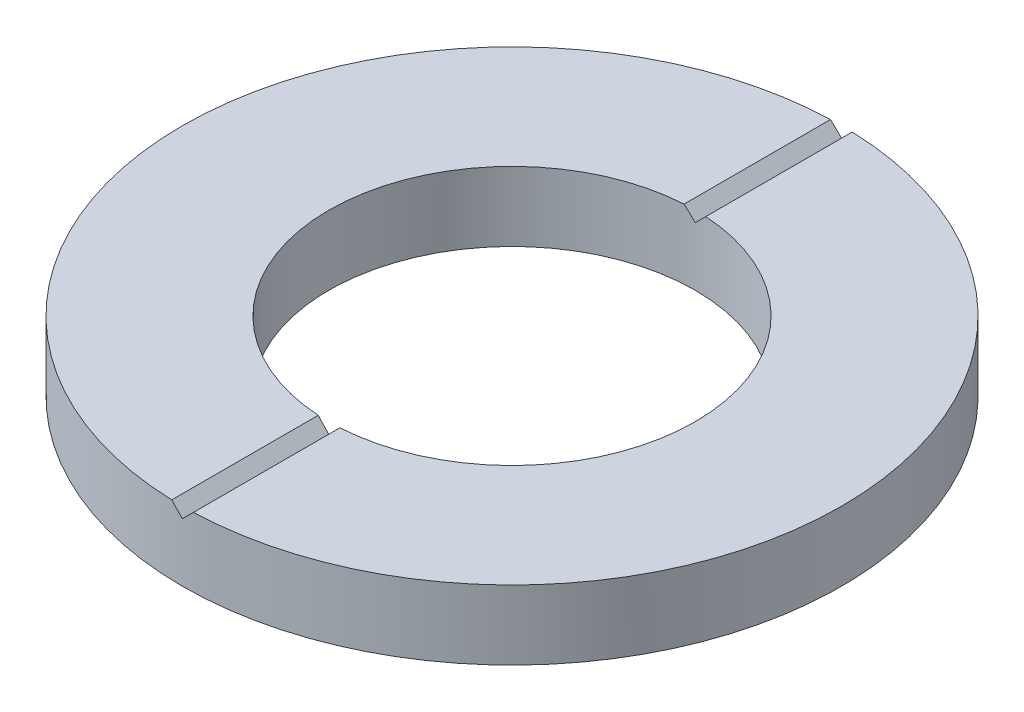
ISO-10303-21;
HEADER;
FILE_DESCRIPTION(('STEP AP214'),'2;1');
FILE_NAME('part.step','',(''),(''),'','','');
FILE_SCHEMA(('AUTOMOTIVE_DESIGN { 1 0 10303 214 1 1 1 1 }'));
ENDSEC;
DATA;
#1=APPLICATION_CONTEXT('core data for automotive mechanical design processes');
#2=APPLICATION_PROTOCOL_DEFINITION('international standard','automotive_design',2000,#1);
#3=PRODUCT_CONTEXT('',#1,'mechanical');
#4=PRODUCT('Part','Part','',(#3));
#5=PRODUCT_RELATED_PRODUCT_CATEGORY('part','',(#4));
#6=PRODUCT_DEFINITION_FORMATION('','',#4);
#7=PRODUCT_DEFINITION_CONTEXT('part definition',#1,'design');
#8=PRODUCT_DEFINITION('design','',#6,#7);
#9=PRODUCT_DEFINITION_SHAPE('','',#8);
#10=(LENGTH_UNIT() NAMED_UNIT(*) SI_UNIT(.MILLI.,.METRE.));
#11=(NAMED_UNIT(*) PLANE_ANGLE_UNIT() SI_UNIT($,.RADIAN.));
#12=(NAMED_UNIT(*) SI_UNIT($,.STERADIAN.) SOLID_ANGLE_UNIT());
#13=UNCERTAINTY_MEASURE_WITH_UNIT(LENGTH_MEASURE(1.E-05),#10,'distance_accuracy_value','');
#14=(GEOMETRIC_REPRESENTATION_CONTEXT(3) GLOBAL_UNCERTAINTY_ASSIGNED_CONTEXT((#13)) GLOBAL_UNIT_ASSIGNED_CONTEXT((#10,
#11,#12)) REPRESENTATION_CONTEXT('',''));
#15=CARTESIAN_POINT('',(0.,0.,0.));
#16=DIRECTION('',(0.,0.,1.));
#17=DIRECTION('',(1.,0.,0.));
#18=AXIS2_PLACEMENT_3D('',#15,#16,#17);
#19=CARTESIAN_POINT('',(0.,0.8128,0.));
#20=DIRECTION('',(0.,1.,0.));
#21=DIRECTION('',(0.,0.,1.));
#22=AXIS2_PLACEMENT_3D('',#19,#20,#21);
#23=PLANE('',#22);
#24=DIRECTION('',(0.,0.,1.));
#25=VECTOR('',#24,1.);
#26=CARTESIAN_POINT('',(0.127,0.8128,-3.8608));
#27=LINE('',#26,#25);
#28=CARTESIAN_POINT('',(0.127,0.8128,2.1425393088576));
#29=VERTEX_POINT('',#28);
#30=CARTESIAN_POINT('',(0.127,0.8128,3.85871061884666));
#31=VERTEX_POINT('',#30);
#32=EDGE_CURVE('E141',#29,#31,#27,.T.);
#33=ORIENTED_EDGE('',*,*,#32,.T.);
#34=CARTESIAN_POINT('',(0.,0.8128,0.));
#35=DIRECTION('',(0.,1.,0.));
#36=DIRECTION('',(0.,0.,1.));
#37=AXIS2_PLACEMENT_3D('',#34,#35,#36);
#38=CIRCLE('',#37,3.8608);
#39=CARTESIAN_POINT('',(0.127,0.8128,-3.85871061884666));
#40=VERTEX_POINT('',#39);
#41=EDGE_CURVE('E108',#31,#40,#38,.T.);
#42=ORIENTED_EDGE('',*,*,#41,.T.);
#43=CARTESIAN_POINT('',(0.127,0.8128,-2.1425393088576));
#44=VERTEX_POINT('',#43);
#45=EDGE_CURVE('E139',#40,#44,#27,.T.);
#46=ORIENTED_EDGE('',*,*,#45,.T.);
#47=CARTESIAN_POINT('',(0.,0.8128,0.));
#48=DIRECTION('',(0.,1.,0.));
#49=DIRECTION('',(0.,0.,1.));
#50=AXIS2_PLACEMENT_3D('',#47,#48,#49);
#51=CIRCLE('',#50,2.1463);
#52=EDGE_CURVE('E114',#29,#44,#51,.T.);
#53=ORIENTED_EDGE('',*,*,#52,.F.);
#54=EDGE_LOOP('',(#33,#42,#46,#53));
#55=FACE_BOUND('',#54,.T.);
#56=ADVANCED_FACE('F34',(#55),#23,.T.);
#57=DIRECTION('',(0.,0.,1.));
#58=VECTOR('',#57,1.);
#59=CARTESIAN_POINT('',(-0.127,0.8128,-3.8608));
#60=LINE('',#59,#58);
#61=CARTESIAN_POINT('',(-0.127,0.8128,-3.85871061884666));
#62=VERTEX_POINT('',#61);
#63=CARTESIAN_POINT('',(-0.127,0.8128,-2.1425393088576));
#64=VERTEX_POINT('',#63);
#65=EDGE_CURVE('E57',#62,#64,#60,.T.);
#66=ORIENTED_EDGE('',*,*,#65,.F.);
#67=CARTESIAN_POINT('',(-0.127,0.8128,3.85871061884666));
#68=VERTEX_POINT('',#67);
#69=EDGE_CURVE('E121',#62,#68,#38,.T.);
#70=ORIENTED_EDGE('',*,*,#69,.T.);
#71=CARTESIAN_POINT('',(-0.127,0.8128,2.1425393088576));
#72=VERTEX_POINT('',#71);
#73=EDGE_CURVE('E88',#72,#68,#60,.T.);
#74=ORIENTED_EDGE('',*,*,#73,.F.);
#75=EDGE_CURVE('E118',#64,#72,#51,.T.);
#76=ORIENTED_EDGE('',*,*,#75,.F.);
#77=EDGE_LOOP('',(#66,#70,#74,#76));
#78=FACE_BOUND('',#77,.T.);
#79=ADVANCED_FACE('F131',(#78),#23,.T.);
#80=CARTESIAN_POINT('',(0.,0.,0.));
#81=DIRECTION('',(0.,1.,0.));
#82=DIRECTION('',(0.,0.,1.));
#83=AXIS2_PLACEMENT_3D('',#80,#81,#82);
#84=PLANE('',#83);
#85=CARTESIAN_POINT('',(0.,0.,0.));
#86=DIRECTION('',(0.,1.,0.));
#87=DIRECTION('',(0.,0.,1.));
#88=AXIS2_PLACEMENT_3D('',#85,#86,#87);
#89=CIRCLE('',#88,3.8608);
#90=CARTESIAN_POINT('',(0.,0.,3.8608));
#91=VERTEX_POINT('',#90);
#92=EDGE_CURVE('E117',#91,#91,#89,.T.);
#93=ORIENTED_EDGE('',*,*,#92,.F.);
#94=EDGE_LOOP('',(#93));
#95=FACE_BOUND('',#94,.T.);
#96=CARTESIAN_POINT('',(0.,0.,0.));
#97=DIRECTION('',(0.,1.,0.));
#98=DIRECTION('',(0.,0.,1.));
#99=AXIS2_PLACEMENT_3D('',#96,#97,#98);
#100=CIRCLE('',#99,2.1463);
#101=CARTESIAN_POINT('',(0.,0.,2.1463));
#102=VERTEX_POINT('',#101);
#103=EDGE_CURVE('E111',#102,#102,#100,.T.);
#104=ORIENTED_EDGE('',*,*,#103,.T.);
#105=EDGE_LOOP('',(#104));
#106=FACE_BOUND('',#105,.T.);
#107=ADVANCED_FACE('F158',(#95,#106),#84,.F.);
#108=CARTESIAN_POINT('',(0.,0.8128,0.));
#109=DIRECTION('',(0.,-1.,0.));
#110=DIRECTION('',(0.,0.,-1.));
#111=AXIS2_PLACEMENT_3D('',#108,#109,#110);
#112=CYLINDRICAL_SURFACE('',#111,3.8608);
#113=CARTESIAN_POINT('',(0.,0.6858,0.));
#114=DIRECTION('',(-0.707106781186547,-0.707106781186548,0.));
#115=DIRECTION('',(0.707106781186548,-0.707106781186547,0.));
#116=AXIS2_PLACEMENT_3D('',#113,#114,#115);
#117=ELLIPSE('',#116,5.45999572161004,3.8608);
#118=CARTESIAN_POINT('',(0.,0.6858,-3.8608));
#119=VERTEX_POINT('',#118);
#120=EDGE_CURVE('E94',#62,#119,#117,.T.);
#121=ORIENTED_EDGE('',*,*,#120,.T.);
#122=CARTESIAN_POINT('',(0.,0.6858,0.));
#123=DIRECTION('',(0.707106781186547,-0.707106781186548,0.));
#124=DIRECTION('',(-0.707106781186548,-0.707106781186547,0.));
#125=AXIS2_PLACEMENT_3D('',#122,#123,#124);
#126=ELLIPSE('',#125,5.45999572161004,3.8608);
#127=EDGE_CURVE('E109',#119,#40,#126,.T.);
#128=ORIENTED_EDGE('',*,*,#127,.T.);
#129=ORIENTED_EDGE('',*,*,#41,.F.);
#130=CARTESIAN_POINT('',(0.,0.6858,3.8608));
#131=VERTEX_POINT('',#130);
#132=EDGE_CURVE('E93',#31,#131,#126,.T.);
#133=ORIENTED_EDGE('',*,*,#132,.T.);
#134=EDGE_CURVE('E85',#131,#68,#117,.T.);
#135=ORIENTED_EDGE('',*,*,#134,.T.);
#136=ORIENTED_EDGE('',*,*,#69,.F.);
#137=EDGE_LOOP('',(#121,#128,#129,#133,#135,#136));
#138=FACE_BOUND('',#137,.T.);
#139=ORIENTED_EDGE('',*,*,#92,.T.);
#140=EDGE_LOOP('',(#139));
#141=FACE_BOUND('',#140,.T.);
#142=ADVANCED_FACE('F36',(#138,#141),#112,.T.);
#143=CARTESIAN_POINT('',(0.,0.8128,0.));
#144=DIRECTION('',(0.,-1.,0.));
#145=DIRECTION('',(0.,0.,-1.));
#146=AXIS2_PLACEMENT_3D('',#143,#144,#145);
#147=CYLINDRICAL_SURFACE('',#146,2.1463);
#148=CARTESIAN_POINT('',(0.,0.6858,0.));
#149=DIRECTION('',(0.707106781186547,-0.707106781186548,0.));
#150=DIRECTION('',(-0.707106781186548,-0.707106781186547,0.));
#151=AXIS2_PLACEMENT_3D('',#148,#149,#150);
#152=ELLIPSE('',#151,3.03532656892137,2.1463);
#153=CARTESIAN_POINT('',(0.,0.6858,2.1463));
#154=VERTEX_POINT('',#153);
#155=EDGE_CURVE('E11',#29,#154,#152,.T.);
#156=ORIENTED_EDGE('',*,*,#155,.F.);
#157=ORIENTED_EDGE('',*,*,#52,.T.);
#158=CARTESIAN_POINT('',(0.,0.6858,-2.1463));
#159=VERTEX_POINT('',#158);
#160=EDGE_CURVE('E38',#159,#44,#152,.T.);
#161=ORIENTED_EDGE('',*,*,#160,.F.);
#162=CARTESIAN_POINT('',(0.,0.6858,0.));
#163=DIRECTION('',(-0.707106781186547,-0.707106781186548,0.));
#164=DIRECTION('',(0.707106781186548,-0.707106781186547,0.));
#165=AXIS2_PLACEMENT_3D('',#162,#163,#164);
#166=ELLIPSE('',#165,3.03532656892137,2.1463);
#167=EDGE_CURVE('E124',#64,#159,#166,.T.);
#168=ORIENTED_EDGE('',*,*,#167,.F.);
#169=ORIENTED_EDGE('',*,*,#75,.T.);
#170=EDGE_CURVE('E43',#154,#72,#166,.T.);
#171=ORIENTED_EDGE('',*,*,#170,.F.);
#172=EDGE_LOOP('',(#156,#157,#161,#168,#169,#171));
#173=FACE_BOUND('',#172,.T.);
#174=ORIENTED_EDGE('',*,*,#103,.F.);
#175=EDGE_LOOP('',(#174));
#176=FACE_BOUND('',#175,.T.);
#177=ADVANCED_FACE('F132',(#173,#176),#147,.F.);
#178=CARTESIAN_POINT('',(-0.127,0.8128,-3.8608));
#179=DIRECTION('',(-0.707106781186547,-0.707106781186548,0.));
#180=DIRECTION('',(0.707106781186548,-0.707106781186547,0.));
#181=AXIS2_PLACEMENT_3D('',#178,#179,#180);
#182=PLANE('',#181);
#183=ORIENTED_EDGE('',*,*,#65,.T.);
#184=ORIENTED_EDGE('',*,*,#167,.T.);
#185=DIRECTION('',(0.,0.,1.));
#186=VECTOR('',#185,1.);
#187=CARTESIAN_POINT('',(0.,0.6858,-3.8608));
#188=LINE('',#187,#186);
#189=EDGE_CURVE('E101',#119,#159,#188,.T.);
#190=ORIENTED_EDGE('',*,*,#189,.F.);
#191=ORIENTED_EDGE('',*,*,#120,.F.);
#192=EDGE_LOOP('',(#183,#184,#190,#191));
#193=FACE_BOUND('',#192,.T.);
#194=ADVANCED_FACE('F143',(#193),#182,.F.);
#195=CARTESIAN_POINT('',(0.,0.6858,-3.8608));
#196=DIRECTION('',(0.707106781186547,-0.707106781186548,0.));
#197=DIRECTION('',(0.707106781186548,0.707106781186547,0.));
#198=AXIS2_PLACEMENT_3D('',#195,#196,#197);
#199=PLANE('',#198);
#200=ORIENTED_EDGE('',*,*,#189,.T.);
#201=ORIENTED_EDGE('',*,*,#160,.T.);
#202=ORIENTED_EDGE('',*,*,#45,.F.);
#203=ORIENTED_EDGE('',*,*,#127,.F.);
#204=EDGE_LOOP('',(#200,#201,#202,#203));
#205=FACE_BOUND('',#204,.T.);
#206=ADVANCED_FACE('F138',(#205),#199,.F.);
#207=ORIENTED_EDGE('',*,*,#32,.F.);
#208=ORIENTED_EDGE('',*,*,#155,.T.);
#209=EDGE_CURVE('E50',#154,#131,#188,.T.);
#210=ORIENTED_EDGE('',*,*,#209,.T.);
#211=ORIENTED_EDGE('',*,*,#132,.F.);
#212=EDGE_LOOP('',(#207,#208,#210,#211));
#213=FACE_BOUND('',#212,.T.);
#214=ADVANCED_FACE('F97',(#213),#199,.F.);
#215=ORIENTED_EDGE('',*,*,#209,.F.);
#216=ORIENTED_EDGE('',*,*,#170,.T.);
#217=ORIENTED_EDGE('',*,*,#73,.T.);
#218=ORIENTED_EDGE('',*,*,#134,.F.);
#219=EDGE_LOOP('',(#215,#216,#217,#218));
#220=FACE_BOUND('',#219,.T.);
#221=ADVANCED_FACE('F86',(#220),#182,.F.);
#222=CLOSED_SHELL('',(#56,#79,#107,#142,#177,#194,#206,#214,#221));
#223=MANIFOLD_SOLID_BREP('B2',#222);
#224=ADVANCED_BREP_SHAPE_REPRESENTATION('',(#18,#223),#14);
#225=SHAPE_DEFINITION_REPRESENTATION(#9,#224);
ENDSEC;
END-ISO-10303-21;
